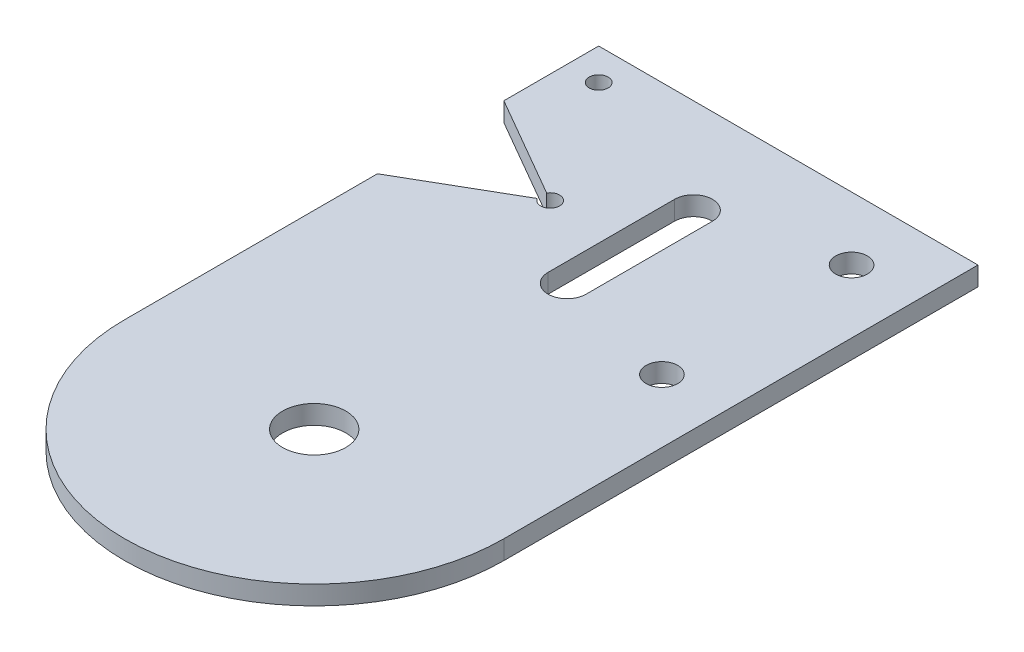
from build123d import *

# Parameters (mm, degrees)
SKETCH1_R      = 5
SKETCH1_R_2    = 2.5
SKETCH1_R_3    = 1.5
EXTRUDE1_DEPTH = 3


with BuildPart() as part:
    # Sketch1 → Extrude1 (new body)
    with BuildSketch(Plane(origin=(0, 0, 0), x_dir=(1, 0, 0), z_dir=(0, 1, 0))):
        with BuildLine():
            Line((0, 30), (0, 70))
            Line((0, 70), (16.02146997, 79.25))
            ThreePointArc((16.02146997, 79.25), (18.820508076, 80), (16.02146997, 80.75))
            Line((16.02146997, 80.75), (0, 90))
            Line((0, 90), (0, 105))
            Line((0, 105), (60, 105))
            Line((60, 105), (60, 30))
            ThreePointArc((60, 30), (30, 0), (0, 30))
        make_face()
        with Locations(Location((30, 30, 0), (0, 0, 270))):
            Circle(SKETCH1_R, mode=Mode.SUBTRACT)
        with Locations(Location((50, 95, 0), (0, 0, 270))):
            Circle(SKETCH1_R_2, mode=Mode.SUBTRACT)
        with Locations(Location((50, 65, 0), (0, 0, 270))):
            Circle(SKETCH1_R_2, mode=Mode.SUBTRACT)
        with Locations(Location((5, 100, 0), (0, 0, 270))):
            Circle(SKETCH1_R_3, mode=Mode.SUBTRACT)
        with BuildLine():
            Line((27, 70), (27, 90))
            ThreePointArc((27, 90), (30, 93), (33, 90))
            Line((33, 90), (33, 70))
            ThreePointArc((33, 70), (30, 67), (27, 70))
        make_face(mode=Mode.SUBTRACT)
    extrude(amount=EXTRUDE1_DEPTH)


solid = part.part
